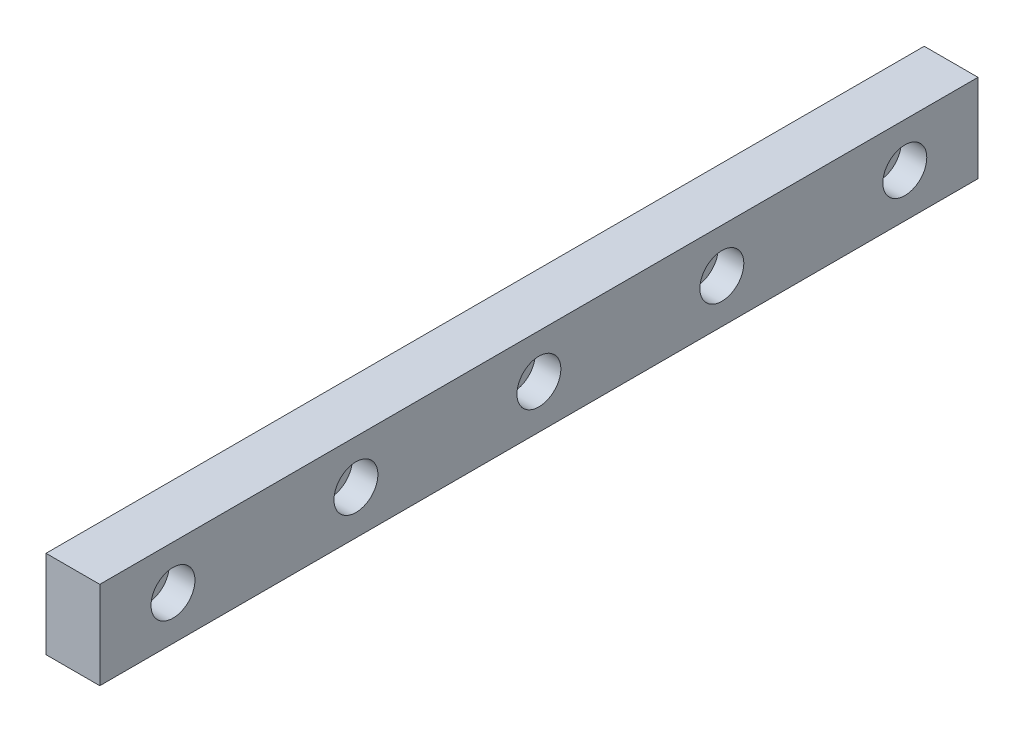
ISO-10303-21;
HEADER;
FILE_DESCRIPTION(('STEP AP214'),'2;1');
FILE_NAME('part.step','',(''),(''),'','','');
FILE_SCHEMA(('AUTOMOTIVE_DESIGN { 1 0 10303 214 1 1 1 1 }'));
ENDSEC;
DATA;
#1=APPLICATION_CONTEXT('core data for automotive mechanical design processes');
#2=APPLICATION_PROTOCOL_DEFINITION('international standard','automotive_design',2000,#1);
#3=PRODUCT_CONTEXT('',#1,'mechanical');
#4=PRODUCT('Part','Part','',(#3));
#5=PRODUCT_RELATED_PRODUCT_CATEGORY('part','',(#4));
#6=PRODUCT_DEFINITION_FORMATION('','',#4);
#7=PRODUCT_DEFINITION_CONTEXT('part definition',#1,'design');
#8=PRODUCT_DEFINITION('design','',#6,#7);
#9=PRODUCT_DEFINITION_SHAPE('','',#8);
#10=(LENGTH_UNIT() NAMED_UNIT(*) SI_UNIT(.MILLI.,.METRE.));
#11=(NAMED_UNIT(*) PLANE_ANGLE_UNIT() SI_UNIT($,.RADIAN.));
#12=(NAMED_UNIT(*) SI_UNIT($,.STERADIAN.) SOLID_ANGLE_UNIT());
#13=UNCERTAINTY_MEASURE_WITH_UNIT(LENGTH_MEASURE(1.E-05),#10,'distance_accuracy_value','');
#14=(GEOMETRIC_REPRESENTATION_CONTEXT(3) GLOBAL_UNCERTAINTY_ASSIGNED_CONTEXT((#13)) GLOBAL_UNIT_ASSIGNED_CONTEXT((#10,
#11,#12)) REPRESENTATION_CONTEXT('',''));
#15=CARTESIAN_POINT('',(0.,0.,0.));
#16=DIRECTION('',(0.,0.,1.));
#17=DIRECTION('',(1.,0.,0.));
#18=AXIS2_PLACEMENT_3D('',#15,#16,#17);
#19=CARTESIAN_POINT('',(-112.650000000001,6.,35.));
#20=DIRECTION('',(1.,0.,0.));
#21=DIRECTION('',(0.,0.,-1.));
#22=AXIS2_PLACEMENT_3D('',#19,#20,#21);
#23=CYLINDRICAL_SURFACE('',#22,1.75);
#24=CARTESIAN_POINT('',(0.,6.,35.));
#25=DIRECTION('',(1.,0.,0.));
#26=DIRECTION('',(0.,0.,-1.));
#27=AXIS2_PLACEMENT_3D('',#24,#25,#26);
#28=CIRCLE('',#27,1.75);
#29=CARTESIAN_POINT('',(0.,6.,33.25));
#30=VERTEX_POINT('',#29);
#31=EDGE_CURVE('E111',#30,#30,#28,.T.);
#32=ORIENTED_EDGE('',*,*,#31,.F.);
#33=EDGE_LOOP('',(#32));
#34=FACE_BOUND('',#33,.T.);
#35=CARTESIAN_POINT('',(3.84999999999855,6.,35.));
#36=DIRECTION('',(1.,0.,0.));
#37=DIRECTION('',(0.,0.,-1.));
#38=AXIS2_PLACEMENT_3D('',#35,#36,#37);
#39=CIRCLE('',#38,1.75);
#40=CARTESIAN_POINT('',(3.84999999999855,6.,33.25));
#41=VERTEX_POINT('',#40);
#42=EDGE_CURVE('E36',#41,#41,#39,.F.);
#43=ORIENTED_EDGE('',*,*,#42,.F.);
#44=EDGE_LOOP('',(#43));
#45=FACE_BOUND('',#44,.T.);
#46=ADVANCED_FACE('F32',(#34,#45),#23,.F.);
#47=CARTESIAN_POINT('',(-112.650000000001,6.,110.));
#48=DIRECTION('',(1.,0.,0.));
#49=DIRECTION('',(0.,0.,-1.));
#50=AXIS2_PLACEMENT_3D('',#47,#48,#49);
#51=CYLINDRICAL_SURFACE('',#50,1.75);
#52=CARTESIAN_POINT('',(0.,6.,110.));
#53=DIRECTION('',(1.,0.,0.));
#54=DIRECTION('',(0.,0.,-1.));
#55=AXIS2_PLACEMENT_3D('',#52,#53,#54);
#56=CIRCLE('',#55,1.75);
#57=CARTESIAN_POINT('',(0.,6.,108.25));
#58=VERTEX_POINT('',#57);
#59=EDGE_CURVE('E153',#58,#58,#56,.T.);
#60=ORIENTED_EDGE('',*,*,#59,.F.);
#61=EDGE_LOOP('',(#60));
#62=FACE_BOUND('',#61,.T.);
#63=CARTESIAN_POINT('',(3.84999999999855,6.,110.));
#64=DIRECTION('',(1.,0.,0.));
#65=DIRECTION('',(0.,0.,-1.));
#66=AXIS2_PLACEMENT_3D('',#63,#64,#65);
#67=CIRCLE('',#66,1.75);
#68=CARTESIAN_POINT('',(3.84999999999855,6.,108.25));
#69=VERTEX_POINT('',#68);
#70=EDGE_CURVE('E122',#69,#69,#67,.F.);
#71=ORIENTED_EDGE('',*,*,#70,.F.);
#72=EDGE_LOOP('',(#71));
#73=FACE_BOUND('',#72,.T.);
#74=ADVANCED_FACE('F190',(#62,#73),#51,.F.);
#75=CARTESIAN_POINT('',(-112.650000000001,6.,85.));
#76=DIRECTION('',(1.,0.,0.));
#77=DIRECTION('',(0.,0.,-1.));
#78=AXIS2_PLACEMENT_3D('',#75,#76,#77);
#79=CYLINDRICAL_SURFACE('',#78,1.75);
#80=CARTESIAN_POINT('',(0.,6.,85.));
#81=DIRECTION('',(1.,0.,0.));
#82=DIRECTION('',(0.,0.,-1.));
#83=AXIS2_PLACEMENT_3D('',#80,#81,#82);
#84=CIRCLE('',#83,1.75);
#85=CARTESIAN_POINT('',(0.,6.,83.25));
#86=VERTEX_POINT('',#85);
#87=EDGE_CURVE('E156',#86,#86,#84,.T.);
#88=ORIENTED_EDGE('',*,*,#87,.F.);
#89=EDGE_LOOP('',(#88));
#90=FACE_BOUND('',#89,.T.);
#91=CARTESIAN_POINT('',(3.84999999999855,6.,85.));
#92=DIRECTION('',(1.,0.,0.));
#93=DIRECTION('',(0.,0.,-1.));
#94=AXIS2_PLACEMENT_3D('',#91,#92,#93);
#95=CIRCLE('',#94,1.75);
#96=CARTESIAN_POINT('',(3.84999999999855,6.,83.25));
#97=VERTEX_POINT('',#96);
#98=EDGE_CURVE('E118',#97,#97,#95,.F.);
#99=ORIENTED_EDGE('',*,*,#98,.F.);
#100=EDGE_LOOP('',(#99));
#101=FACE_BOUND('',#100,.T.);
#102=ADVANCED_FACE('F196',(#90,#101),#79,.F.);
#103=CARTESIAN_POINT('',(-112.650000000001,6.,60.));
#104=DIRECTION('',(1.,0.,0.));
#105=DIRECTION('',(0.,0.,-1.));
#106=AXIS2_PLACEMENT_3D('',#103,#104,#105);
#107=CYLINDRICAL_SURFACE('',#106,1.75);
#108=CARTESIAN_POINT('',(0.,6.,60.));
#109=DIRECTION('',(1.,0.,0.));
#110=DIRECTION('',(0.,0.,-1.));
#111=AXIS2_PLACEMENT_3D('',#108,#109,#110);
#112=CIRCLE('',#111,1.75);
#113=CARTESIAN_POINT('',(0.,6.,58.25));
#114=VERTEX_POINT('',#113);
#115=EDGE_CURVE('E159',#114,#114,#112,.T.);
#116=ORIENTED_EDGE('',*,*,#115,.F.);
#117=EDGE_LOOP('',(#116));
#118=FACE_BOUND('',#117,.T.);
#119=CARTESIAN_POINT('',(3.84999999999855,6.,60.));
#120=DIRECTION('',(1.,0.,0.));
#121=DIRECTION('',(0.,0.,-1.));
#122=AXIS2_PLACEMENT_3D('',#119,#120,#121);
#123=CIRCLE('',#122,1.75);
#124=CARTESIAN_POINT('',(3.84999999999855,6.,58.25));
#125=VERTEX_POINT('',#124);
#126=EDGE_CURVE('E113',#125,#125,#123,.F.);
#127=ORIENTED_EDGE('',*,*,#126,.F.);
#128=EDGE_LOOP('',(#127));
#129=FACE_BOUND('',#128,.T.);
#130=ADVANCED_FACE('F169',(#118,#129),#107,.F.);
#131=CARTESIAN_POINT('',(-112.650000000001,6.,10.));
#132=DIRECTION('',(1.,0.,0.));
#133=DIRECTION('',(0.,0.,-1.));
#134=AXIS2_PLACEMENT_3D('',#131,#132,#133);
#135=CYLINDRICAL_SURFACE('',#134,1.75);
#136=CARTESIAN_POINT('',(0.,6.,10.));
#137=DIRECTION('',(1.,0.,0.));
#138=DIRECTION('',(0.,0.,-1.));
#139=AXIS2_PLACEMENT_3D('',#136,#137,#138);
#140=CIRCLE('',#139,1.75);
#141=CARTESIAN_POINT('',(0.,6.,8.25));
#142=VERTEX_POINT('',#141);
#143=EDGE_CURVE('E102',#142,#142,#140,.T.);
#144=ORIENTED_EDGE('',*,*,#143,.F.);
#145=EDGE_LOOP('',(#144));
#146=FACE_BOUND('',#145,.T.);
#147=CARTESIAN_POINT('',(3.84999999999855,6.,10.));
#148=DIRECTION('',(1.,0.,0.));
#149=DIRECTION('',(0.,0.,-1.));
#150=AXIS2_PLACEMENT_3D('',#147,#148,#149);
#151=CIRCLE('',#150,1.75);
#152=CARTESIAN_POINT('',(3.84999999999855,6.,8.25));
#153=VERTEX_POINT('',#152);
#154=EDGE_CURVE('E108',#153,#153,#151,.F.);
#155=ORIENTED_EDGE('',*,*,#154,.F.);
#156=EDGE_LOOP('',(#155));
#157=FACE_BOUND('',#156,.T.);
#158=ADVANCED_FACE('F166',(#146,#157),#135,.F.);
#159=CARTESIAN_POINT('',(0.,12.,120.));
#160=DIRECTION('',(0.,-1.,0.));
#161=DIRECTION('',(0.,0.,-1.));
#162=AXIS2_PLACEMENT_3D('',#159,#160,#161);
#163=PLANE('',#162);
#164=DIRECTION('',(-1.,0.,0.));
#165=VECTOR('',#164,1.);
#166=CARTESIAN_POINT('',(0.,12.,0.));
#167=LINE('',#166,#165);
#168=CARTESIAN_POINT('',(7.34999999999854,12.,0.));
#169=VERTEX_POINT('',#168);
#170=CARTESIAN_POINT('',(0.,12.,0.));
#171=VERTEX_POINT('',#170);
#172=EDGE_CURVE('E99',#169,#171,#167,.T.);
#173=ORIENTED_EDGE('',*,*,#172,.T.);
#174=DIRECTION('',(0.,0.,-1.));
#175=VECTOR('',#174,1.);
#176=CARTESIAN_POINT('',(0.,12.,120.));
#177=LINE('',#176,#175);
#178=CARTESIAN_POINT('',(0.,12.,120.));
#179=VERTEX_POINT('',#178);
#180=EDGE_CURVE('E11',#179,#171,#177,.T.);
#181=ORIENTED_EDGE('',*,*,#180,.F.);
#182=DIRECTION('',(-1.,0.,0.));
#183=VECTOR('',#182,1.);
#184=CARTESIAN_POINT('',(0.,12.,120.));
#185=LINE('',#184,#183);
#186=CARTESIAN_POINT('',(7.34999999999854,12.,120.));
#187=VERTEX_POINT('',#186);
#188=EDGE_CURVE('E86',#187,#179,#185,.T.);
#189=ORIENTED_EDGE('',*,*,#188,.F.);
#190=DIRECTION('',(0.,0.,-1.));
#191=VECTOR('',#190,1.);
#192=CARTESIAN_POINT('',(7.34999999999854,12.,120.));
#193=LINE('',#192,#191);
#194=EDGE_CURVE('E95',#187,#169,#193,.T.);
#195=ORIENTED_EDGE('',*,*,#194,.T.);
#196=EDGE_LOOP('',(#173,#181,#189,#195));
#197=FACE_BOUND('',#196,.T.);
#198=ADVANCED_FACE('F34',(#197),#163,.F.);
#199=CARTESIAN_POINT('',(0.,12.,120.));
#200=DIRECTION('',(1.,0.,0.));
#201=DIRECTION('',(0.,0.,-1.));
#202=AXIS2_PLACEMENT_3D('',#199,#200,#201);
#203=PLANE('',#202);
#204=ORIENTED_EDGE('',*,*,#31,.T.);
#205=EDGE_LOOP('',(#204));
#206=FACE_BOUND('',#205,.T.);
#207=ORIENTED_EDGE('',*,*,#59,.T.);
#208=EDGE_LOOP('',(#207));
#209=FACE_BOUND('',#208,.T.);
#210=ORIENTED_EDGE('',*,*,#87,.T.);
#211=EDGE_LOOP('',(#210));
#212=FACE_BOUND('',#211,.T.);
#213=ORIENTED_EDGE('',*,*,#115,.T.);
#214=EDGE_LOOP('',(#213));
#215=FACE_BOUND('',#214,.T.);
#216=ORIENTED_EDGE('',*,*,#143,.T.);
#217=EDGE_LOOP('',(#216));
#218=FACE_BOUND('',#217,.T.);
#219=DIRECTION('',(0.,-1.,0.));
#220=VECTOR('',#219,1.);
#221=CARTESIAN_POINT('',(0.,12.,0.));
#222=LINE('',#221,#220);
#223=CARTESIAN_POINT('',(0.,0.,0.));
#224=VERTEX_POINT('',#223);
#225=EDGE_CURVE('E90',#171,#224,#222,.T.);
#226=ORIENTED_EDGE('',*,*,#225,.T.);
#227=DIRECTION('',(0.,0.,-1.));
#228=VECTOR('',#227,1.);
#229=CARTESIAN_POINT('',(0.,0.,120.));
#230=LINE('',#229,#228);
#231=CARTESIAN_POINT('',(0.,0.,120.));
#232=VERTEX_POINT('',#231);
#233=EDGE_CURVE('E42',#232,#224,#230,.T.);
#234=ORIENTED_EDGE('',*,*,#233,.F.);
#235=DIRECTION('',(0.,-1.,0.));
#236=VECTOR('',#235,1.);
#237=CARTESIAN_POINT('',(0.,12.,120.));
#238=LINE('',#237,#236);
#239=EDGE_CURVE('E81',#179,#232,#238,.T.);
#240=ORIENTED_EDGE('',*,*,#239,.F.);
#241=ORIENTED_EDGE('',*,*,#180,.T.);
#242=EDGE_LOOP('',(#226,#234,#240,#241));
#243=FACE_BOUND('',#242,.T.);
#244=ADVANCED_FACE('F89',(#206,#209,#212,#215,#218,#243),#203,.F.);
#245=CARTESIAN_POINT('',(0.,0.,120.));
#246=DIRECTION('',(0.,1.,0.));
#247=DIRECTION('',(0.,0.,1.));
#248=AXIS2_PLACEMENT_3D('',#245,#246,#247);
#249=PLANE('',#248);
#250=DIRECTION('',(1.,0.,0.));
#251=VECTOR('',#250,1.);
#252=CARTESIAN_POINT('',(0.,0.,0.));
#253=LINE('',#252,#251);
#254=CARTESIAN_POINT('',(7.34999999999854,0.,0.));
#255=VERTEX_POINT('',#254);
#256=EDGE_CURVE('E68',#224,#255,#253,.T.);
#257=ORIENTED_EDGE('',*,*,#256,.T.);
#258=DIRECTION('',(0.,0.,-1.));
#259=VECTOR('',#258,1.);
#260=CARTESIAN_POINT('',(7.34999999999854,0.,120.));
#261=LINE('',#260,#259);
#262=CARTESIAN_POINT('',(7.34999999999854,0.,120.));
#263=VERTEX_POINT('',#262);
#264=EDGE_CURVE('E91',#263,#255,#261,.T.);
#265=ORIENTED_EDGE('',*,*,#264,.F.);
#266=DIRECTION('',(1.,0.,0.));
#267=VECTOR('',#266,1.);
#268=CARTESIAN_POINT('',(0.,0.,120.));
#269=LINE('',#268,#267);
#270=EDGE_CURVE('E84',#232,#263,#269,.T.);
#271=ORIENTED_EDGE('',*,*,#270,.F.);
#272=ORIENTED_EDGE('',*,*,#233,.T.);
#273=EDGE_LOOP('',(#257,#265,#271,#272));
#274=FACE_BOUND('',#273,.T.);
#275=ADVANCED_FACE('F93',(#274),#249,.F.);
#276=CARTESIAN_POINT('',(7.34999999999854,12.,120.));
#277=DIRECTION('',(-1.,0.,0.));
#278=DIRECTION('',(0.,0.,1.));
#279=AXIS2_PLACEMENT_3D('',#276,#277,#278);
#280=PLANE('',#279);
#281=CARTESIAN_POINT('',(7.34999999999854,6.,35.));
#282=DIRECTION('',(1.,0.,0.));
#283=DIRECTION('',(0.,0.,-1.));
#284=AXIS2_PLACEMENT_3D('',#281,#282,#283);
#285=CIRCLE('',#284,3.);
#286=CARTESIAN_POINT('',(7.34999999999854,6.,32.));
#287=VERTEX_POINT('',#286);
#288=EDGE_CURVE('E138',#287,#287,#285,.T.);
#289=ORIENTED_EDGE('',*,*,#288,.F.);
#290=EDGE_LOOP('',(#289));
#291=FACE_BOUND('',#290,.T.);
#292=CARTESIAN_POINT('',(7.34999999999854,6.,110.));
#293=DIRECTION('',(1.,0.,0.));
#294=DIRECTION('',(0.,0.,-1.));
#295=AXIS2_PLACEMENT_3D('',#292,#293,#294);
#296=CIRCLE('',#295,3.);
#297=CARTESIAN_POINT('',(7.34999999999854,6.,107.));
#298=VERTEX_POINT('',#297);
#299=EDGE_CURVE('E131',#298,#298,#296,.T.);
#300=ORIENTED_EDGE('',*,*,#299,.F.);
#301=EDGE_LOOP('',(#300));
#302=FACE_BOUND('',#301,.T.);
#303=CARTESIAN_POINT('',(7.34999999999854,6.,85.));
#304=DIRECTION('',(1.,0.,0.));
#305=DIRECTION('',(0.,0.,-1.));
#306=AXIS2_PLACEMENT_3D('',#303,#304,#305);
#307=CIRCLE('',#306,3.);
#308=CARTESIAN_POINT('',(7.34999999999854,6.,82.));
#309=VERTEX_POINT('',#308);
#310=EDGE_CURVE('E124',#309,#309,#307,.T.);
#311=ORIENTED_EDGE('',*,*,#310,.F.);
#312=EDGE_LOOP('',(#311));
#313=FACE_BOUND('',#312,.T.);
#314=CARTESIAN_POINT('',(7.34999999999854,6.,60.));
#315=DIRECTION('',(1.,0.,0.));
#316=DIRECTION('',(0.,0.,-1.));
#317=AXIS2_PLACEMENT_3D('',#314,#315,#316);
#318=CIRCLE('',#317,3.);
#319=CARTESIAN_POINT('',(7.34999999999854,6.,57.));
#320=VERTEX_POINT('',#319);
#321=EDGE_CURVE('E120',#320,#320,#318,.T.);
#322=ORIENTED_EDGE('',*,*,#321,.F.);
#323=EDGE_LOOP('',(#322));
#324=FACE_BOUND('',#323,.T.);
#325=CARTESIAN_POINT('',(7.34999999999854,6.,10.));
#326=DIRECTION('',(1.,0.,0.));
#327=DIRECTION('',(0.,0.,-1.));
#328=AXIS2_PLACEMENT_3D('',#325,#326,#327);
#329=CIRCLE('',#328,3.);
#330=CARTESIAN_POINT('',(7.34999999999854,6.,7.));
#331=VERTEX_POINT('',#330);
#332=EDGE_CURVE('E116',#331,#331,#329,.T.);
#333=ORIENTED_EDGE('',*,*,#332,.F.);
#334=EDGE_LOOP('',(#333));
#335=FACE_BOUND('',#334,.T.);
#336=DIRECTION('',(0.,1.,0.));
#337=VECTOR('',#336,1.);
#338=CARTESIAN_POINT('',(7.34999999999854,12.,0.));
#339=LINE('',#338,#337);
#340=EDGE_CURVE('E74',#255,#169,#339,.T.);
#341=ORIENTED_EDGE('',*,*,#340,.T.);
#342=ORIENTED_EDGE('',*,*,#194,.F.);
#343=DIRECTION('',(0.,1.,0.));
#344=VECTOR('',#343,1.);
#345=CARTESIAN_POINT('',(7.34999999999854,12.,120.));
#346=LINE('',#345,#344);
#347=EDGE_CURVE('E51',#263,#187,#346,.T.);
#348=ORIENTED_EDGE('',*,*,#347,.F.);
#349=ORIENTED_EDGE('',*,*,#264,.T.);
#350=EDGE_LOOP('',(#341,#342,#348,#349));
#351=FACE_BOUND('',#350,.T.);
#352=ADVANCED_FACE('F209',(#291,#302,#313,#324,#335,#351),#280,.F.);
#353=CARTESIAN_POINT('',(7.34999999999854,12.,120.));
#354=DIRECTION('',(0.,0.,-1.));
#355=DIRECTION('',(-1.,0.,0.));
#356=AXIS2_PLACEMENT_3D('',#353,#354,#355);
#357=PLANE('',#356);
#358=ORIENTED_EDGE('',*,*,#188,.T.);
#359=ORIENTED_EDGE('',*,*,#239,.T.);
#360=ORIENTED_EDGE('',*,*,#270,.T.);
#361=ORIENTED_EDGE('',*,*,#347,.T.);
#362=EDGE_LOOP('',(#358,#359,#360,#361));
#363=FACE_BOUND('',#362,.T.);
#364=ADVANCED_FACE('F82',(#363),#357,.F.);
#365=CARTESIAN_POINT('',(7.34999999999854,12.,0.));
#366=DIRECTION('',(0.,0.,-1.));
#367=DIRECTION('',(-1.,0.,0.));
#368=AXIS2_PLACEMENT_3D('',#365,#366,#367);
#369=PLANE('',#368);
#370=ORIENTED_EDGE('',*,*,#172,.F.);
#371=ORIENTED_EDGE('',*,*,#340,.F.);
#372=ORIENTED_EDGE('',*,*,#256,.F.);
#373=ORIENTED_EDGE('',*,*,#225,.F.);
#374=EDGE_LOOP('',(#370,#371,#372,#373));
#375=FACE_BOUND('',#374,.T.);
#376=ADVANCED_FACE('F176',(#375),#369,.T.);
#377=CARTESIAN_POINT('',(3.84999999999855,6.,10.));
#378=DIRECTION('',(1.,0.,0.));
#379=DIRECTION('',(0.,0.,-1.));
#380=AXIS2_PLACEMENT_3D('',#377,#378,#379);
#381=PLANE('',#380);
#382=CARTESIAN_POINT('',(3.84999999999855,6.,10.));
#383=DIRECTION('',(1.,0.,0.));
#384=DIRECTION('',(0.,0.,-1.));
#385=AXIS2_PLACEMENT_3D('',#382,#383,#384);
#386=CIRCLE('',#385,3.);
#387=CARTESIAN_POINT('',(3.84999999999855,6.,7.));
#388=VERTEX_POINT('',#387);
#389=EDGE_CURVE('E112',#388,#388,#386,.T.);
#390=ORIENTED_EDGE('',*,*,#389,.T.);
#391=EDGE_LOOP('',(#390));
#392=FACE_BOUND('',#391,.T.);
#393=ORIENTED_EDGE('',*,*,#154,.T.);
#394=EDGE_LOOP('',(#393));
#395=FACE_BOUND('',#394,.T.);
#396=ADVANCED_FACE('F173',(#392,#395),#381,.T.);
#397=CARTESIAN_POINT('',(3.84999999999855,6.,10.));
#398=DIRECTION('',(1.,0.,0.));
#399=DIRECTION('',(0.,0.,-1.));
#400=AXIS2_PLACEMENT_3D('',#397,#398,#399);
#401=CYLINDRICAL_SURFACE('',#400,3.);
#402=ORIENTED_EDGE('',*,*,#389,.F.);
#403=EDGE_LOOP('',(#402));
#404=FACE_BOUND('',#403,.T.);
#405=ORIENTED_EDGE('',*,*,#332,.T.);
#406=EDGE_LOOP('',(#405));
#407=FACE_BOUND('',#406,.T.);
#408=ADVANCED_FACE('F175',(#404,#407),#401,.F.);
#409=CARTESIAN_POINT('',(3.84999999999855,6.,60.));
#410=DIRECTION('',(1.,0.,0.));
#411=DIRECTION('',(0.,0.,-1.));
#412=AXIS2_PLACEMENT_3D('',#409,#410,#411);
#413=PLANE('',#412);
#414=CARTESIAN_POINT('',(3.84999999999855,6.,60.));
#415=DIRECTION('',(1.,0.,0.));
#416=DIRECTION('',(0.,0.,-1.));
#417=AXIS2_PLACEMENT_3D('',#414,#415,#416);
#418=CIRCLE('',#417,3.);
#419=CARTESIAN_POINT('',(3.84999999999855,6.,57.));
#420=VERTEX_POINT('',#419);
#421=EDGE_CURVE('E117',#420,#420,#418,.T.);
#422=ORIENTED_EDGE('',*,*,#421,.T.);
#423=EDGE_LOOP('',(#422));
#424=FACE_BOUND('',#423,.T.);
#425=ORIENTED_EDGE('',*,*,#126,.T.);
#426=EDGE_LOOP('',(#425));
#427=FACE_BOUND('',#426,.T.);
#428=ADVANCED_FACE('F183',(#424,#427),#413,.T.);
#429=CARTESIAN_POINT('',(3.84999999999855,6.,60.));
#430=DIRECTION('',(1.,0.,0.));
#431=DIRECTION('',(0.,0.,-1.));
#432=AXIS2_PLACEMENT_3D('',#429,#430,#431);
#433=CYLINDRICAL_SURFACE('',#432,3.);
#434=ORIENTED_EDGE('',*,*,#421,.F.);
#435=EDGE_LOOP('',(#434));
#436=FACE_BOUND('',#435,.T.);
#437=ORIENTED_EDGE('',*,*,#321,.T.);
#438=EDGE_LOOP('',(#437));
#439=FACE_BOUND('',#438,.T.);
#440=ADVANCED_FACE('F231',(#436,#439),#433,.F.);
#441=CARTESIAN_POINT('',(3.84999999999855,6.,85.));
#442=DIRECTION('',(1.,0.,0.));
#443=DIRECTION('',(0.,0.,-1.));
#444=AXIS2_PLACEMENT_3D('',#441,#442,#443);
#445=PLANE('',#444);
#446=CARTESIAN_POINT('',(3.84999999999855,6.,85.));
#447=DIRECTION('',(1.,0.,0.));
#448=DIRECTION('',(0.,0.,-1.));
#449=AXIS2_PLACEMENT_3D('',#446,#447,#448);
#450=CIRCLE('',#449,3.);
#451=CARTESIAN_POINT('',(3.84999999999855,6.,82.));
#452=VERTEX_POINT('',#451);
#453=EDGE_CURVE('E121',#452,#452,#450,.T.);
#454=ORIENTED_EDGE('',*,*,#453,.T.);
#455=EDGE_LOOP('',(#454));
#456=FACE_BOUND('',#455,.T.);
#457=ORIENTED_EDGE('',*,*,#98,.T.);
#458=EDGE_LOOP('',(#457));
#459=FACE_BOUND('',#458,.T.);
#460=ADVANCED_FACE('F237',(#456,#459),#445,.T.);
#461=CARTESIAN_POINT('',(3.84999999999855,6.,85.));
#462=DIRECTION('',(1.,0.,0.));
#463=DIRECTION('',(0.,0.,-1.));
#464=AXIS2_PLACEMENT_3D('',#461,#462,#463);
#465=CYLINDRICAL_SURFACE('',#464,3.);
#466=ORIENTED_EDGE('',*,*,#453,.F.);
#467=EDGE_LOOP('',(#466));
#468=FACE_BOUND('',#467,.T.);
#469=ORIENTED_EDGE('',*,*,#310,.T.);
#470=EDGE_LOOP('',(#469));
#471=FACE_BOUND('',#470,.T.);
#472=ADVANCED_FACE('F240',(#468,#471),#465,.F.);
#473=CARTESIAN_POINT('',(3.84999999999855,6.,110.));
#474=DIRECTION('',(1.,0.,0.));
#475=DIRECTION('',(0.,0.,-1.));
#476=AXIS2_PLACEMENT_3D('',#473,#474,#475);
#477=PLANE('',#476);
#478=CARTESIAN_POINT('',(3.84999999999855,6.,110.));
#479=DIRECTION('',(1.,0.,0.));
#480=DIRECTION('',(0.,0.,-1.));
#481=AXIS2_PLACEMENT_3D('',#478,#479,#480);
#482=CIRCLE('',#481,3.);
#483=CARTESIAN_POINT('',(3.84999999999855,6.,107.));
#484=VERTEX_POINT('',#483);
#485=EDGE_CURVE('E125',#484,#484,#482,.T.);
#486=ORIENTED_EDGE('',*,*,#485,.T.);
#487=EDGE_LOOP('',(#486));
#488=FACE_BOUND('',#487,.T.);
#489=ORIENTED_EDGE('',*,*,#70,.T.);
#490=EDGE_LOOP('',(#489));
#491=FACE_BOUND('',#490,.T.);
#492=ADVANCED_FACE('F243',(#488,#491),#477,.T.);
#493=CARTESIAN_POINT('',(3.84999999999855,6.,110.));
#494=DIRECTION('',(1.,0.,0.));
#495=DIRECTION('',(0.,0.,-1.));
#496=AXIS2_PLACEMENT_3D('',#493,#494,#495);
#497=CYLINDRICAL_SURFACE('',#496,3.);
#498=ORIENTED_EDGE('',*,*,#485,.F.);
#499=EDGE_LOOP('',(#498));
#500=FACE_BOUND('',#499,.T.);
#501=ORIENTED_EDGE('',*,*,#299,.T.);
#502=EDGE_LOOP('',(#501));
#503=FACE_BOUND('',#502,.T.);
#504=ADVANCED_FACE('F248',(#500,#503),#497,.F.);
#505=CARTESIAN_POINT('',(3.84999999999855,6.,35.));
#506=DIRECTION('',(1.,0.,0.));
#507=DIRECTION('',(0.,0.,-1.));
#508=AXIS2_PLACEMENT_3D('',#505,#506,#507);
#509=PLANE('',#508);
#510=CARTESIAN_POINT('',(3.84999999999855,6.,35.));
#511=DIRECTION('',(1.,0.,0.));
#512=DIRECTION('',(0.,0.,-1.));
#513=AXIS2_PLACEMENT_3D('',#510,#511,#512);
#514=CIRCLE('',#513,3.);
#515=CARTESIAN_POINT('',(3.84999999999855,6.,32.));
#516=VERTEX_POINT('',#515);
#517=EDGE_CURVE('E266',#516,#516,#514,.T.);
#518=ORIENTED_EDGE('',*,*,#517,.T.);
#519=EDGE_LOOP('',(#518));
#520=FACE_BOUND('',#519,.T.);
#521=ORIENTED_EDGE('',*,*,#42,.T.);
#522=EDGE_LOOP('',(#521));
#523=FACE_BOUND('',#522,.T.);
#524=ADVANCED_FACE('F251',(#520,#523),#509,.T.);
#525=CARTESIAN_POINT('',(3.84999999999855,6.,35.));
#526=DIRECTION('',(1.,0.,0.));
#527=DIRECTION('',(0.,0.,-1.));
#528=AXIS2_PLACEMENT_3D('',#525,#526,#527);
#529=CYLINDRICAL_SURFACE('',#528,3.);
#530=ORIENTED_EDGE('',*,*,#517,.F.);
#531=EDGE_LOOP('',(#530));
#532=FACE_BOUND('',#531,.T.);
#533=ORIENTED_EDGE('',*,*,#288,.T.);
#534=EDGE_LOOP('',(#533));
#535=FACE_BOUND('',#534,.T.);
#536=ADVANCED_FACE('F255',(#532,#535),#529,.F.);
#537=CLOSED_SHELL('',(#46,#74,#102,#130,#158,#198,#244,#275,#352,#364,#376,#396,#408,#428,#440,
#460,#472,#492,#504,#524,#536));
#538=MANIFOLD_SOLID_BREP('B2',#537);
#539=ADVANCED_BREP_SHAPE_REPRESENTATION('',(#18,#538),#14);
#540=SHAPE_DEFINITION_REPRESENTATION(#9,#539);
ENDSEC;
END-ISO-10303-21;
